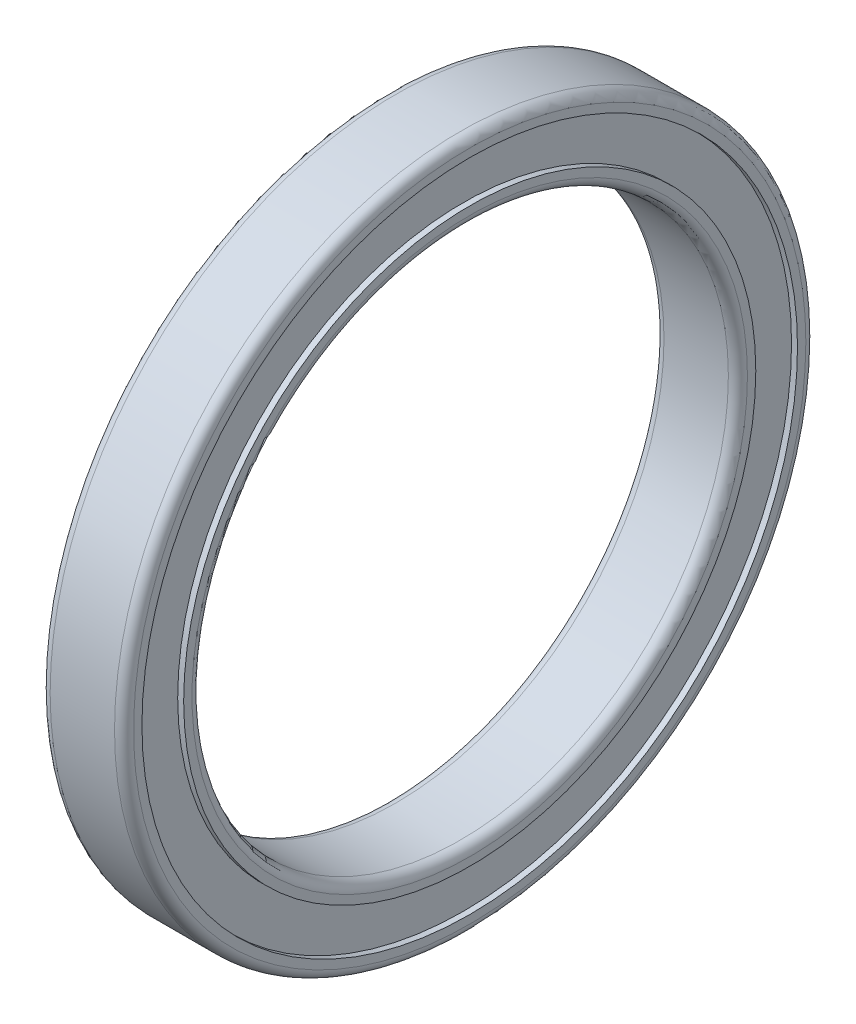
from build123d import *

# Parameters (mm, degrees)
FILLET_1_R = 0.8


with BuildPart() as part:
    # Sketch 1 → Revolve 1 (revolve)
    with BuildSketch(Plane.XY, mode=Mode.PRIVATE) as revolve_1_sk:
        Polygon((3.5, 22.5), (-3.5, 22.5), (-3.5, 24), (-3, 24), (-3, 27.5), (-3.5, 27.5), (-3.5, 29), (3.5, 29), (3.5, 27.5), (3, 27.5), (3, 24), (3.5, 24), align=None)
    revolve(revolve_1_sk.sketch.rotate(Axis((0, 0, 0), (-1, 0, 0)), 90), axis=Axis((0, 0, 0), (-1, 0, 0)))

    # Fillet 1
    fillet_1_edges = [part.edges().sort_by_distance(p)[0] for p in [
        (-3.5, 0, 29),
        (3.5, 0, 29),
        (3.5, 0, 22.5),
        (-3.5, 0, 22.5),
    ]]
    fillet(fillet_1_edges, radius=FILLET_1_R)


solid = part.part
